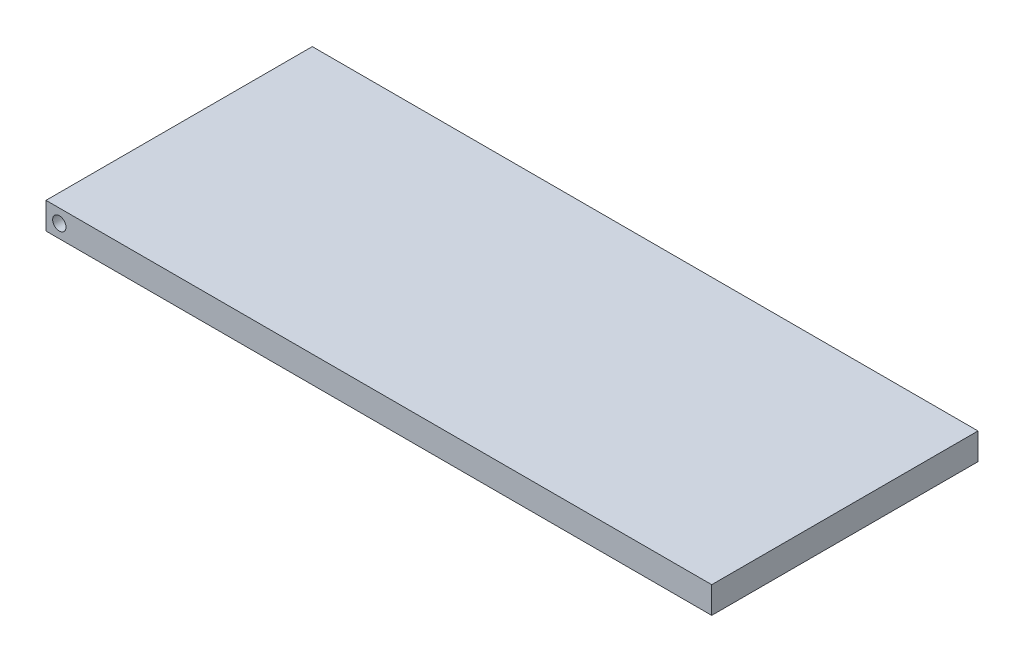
ISO-10303-21;
HEADER;
FILE_DESCRIPTION(('STEP AP214'),'2;1');
FILE_NAME('part.step','',(''),(''),'','','');
FILE_SCHEMA(('AUTOMOTIVE_DESIGN { 1 0 10303 214 1 1 1 1 }'));
ENDSEC;
DATA;
#1=APPLICATION_CONTEXT('core data for automotive mechanical design processes');
#2=APPLICATION_PROTOCOL_DEFINITION('international standard','automotive_design',2000,#1);
#3=PRODUCT_CONTEXT('',#1,'mechanical');
#4=PRODUCT('Part','Part','',(#3));
#5=PRODUCT_RELATED_PRODUCT_CATEGORY('part','',(#4));
#6=PRODUCT_DEFINITION_FORMATION('','',#4);
#7=PRODUCT_DEFINITION_CONTEXT('part definition',#1,'design');
#8=PRODUCT_DEFINITION('design','',#6,#7);
#9=PRODUCT_DEFINITION_SHAPE('','',#8);
#10=(LENGTH_UNIT() NAMED_UNIT(*) SI_UNIT(.MILLI.,.METRE.));
#11=(NAMED_UNIT(*) PLANE_ANGLE_UNIT() SI_UNIT($,.RADIAN.));
#12=(NAMED_UNIT(*) SI_UNIT($,.STERADIAN.) SOLID_ANGLE_UNIT());
#13=UNCERTAINTY_MEASURE_WITH_UNIT(LENGTH_MEASURE(1.E-05),#10,'distance_accuracy_value','');
#14=(GEOMETRIC_REPRESENTATION_CONTEXT(3) GLOBAL_UNCERTAINTY_ASSIGNED_CONTEXT((#13)) GLOBAL_UNIT_ASSIGNED_CONTEXT((#10,
#11,#12)) REPRESENTATION_CONTEXT('',''));
#15=CARTESIAN_POINT('',(0.,0.,0.));
#16=DIRECTION('',(0.,0.,1.));
#17=DIRECTION('',(1.,0.,0.));
#18=AXIS2_PLACEMENT_3D('',#15,#16,#17);
#19=CARTESIAN_POINT('',(0.,0.,-200.));
#20=DIRECTION('',(-1.,0.,0.));
#21=DIRECTION('',(0.,0.,1.));
#22=AXIS2_PLACEMENT_3D('',#19,#20,#21);
#23=PLANE('',#22);
#24=DIRECTION('',(0.,-1.,0.));
#25=VECTOR('',#24,1.);
#26=CARTESIAN_POINT('',(0.,0.,0.));
#27=LINE('',#26,#25);
#28=CARTESIAN_POINT('',(0.,20.,0.));
#29=VERTEX_POINT('',#28);
#30=CARTESIAN_POINT('',(0.,0.,0.));
#31=VERTEX_POINT('',#30);
#32=EDGE_CURVE('E98',#29,#31,#27,.T.);
#33=ORIENTED_EDGE('',*,*,#32,.F.);
#34=DIRECTION('',(0.,0.,1.));
#35=VECTOR('',#34,1.);
#36=CARTESIAN_POINT('',(0.,20.,-200.));
#37=LINE('',#36,#35);
#38=CARTESIAN_POINT('',(0.,20.,-200.));
#39=VERTEX_POINT('',#38);
#40=EDGE_CURVE('E11',#39,#29,#37,.T.);
#41=ORIENTED_EDGE('',*,*,#40,.F.);
#42=DIRECTION('',(0.,-1.,0.));
#43=VECTOR('',#42,1.);
#44=CARTESIAN_POINT('',(0.,0.,-200.));
#45=LINE('',#44,#43);
#46=CARTESIAN_POINT('',(0.,0.,-200.));
#47=VERTEX_POINT('',#46);
#48=EDGE_CURVE('E91',#39,#47,#45,.T.);
#49=ORIENTED_EDGE('',*,*,#48,.T.);
#50=DIRECTION('',(0.,0.,1.));
#51=VECTOR('',#50,1.);
#52=CARTESIAN_POINT('',(0.,0.,-200.));
#53=LINE('',#52,#51);
#54=EDGE_CURVE('E36',#47,#31,#53,.T.);
#55=ORIENTED_EDGE('',*,*,#54,.T.);
#56=EDGE_LOOP('',(#33,#41,#49,#55));
#57=FACE_BOUND('',#56,.T.);
#58=ADVANCED_FACE('F33',(#57),#23,.T.);
#59=CARTESIAN_POINT('',(0.,20.,-200.));
#60=DIRECTION('',(0.,1.,0.));
#61=DIRECTION('',(0.,0.,1.));
#62=AXIS2_PLACEMENT_3D('',#59,#60,#61);
#63=PLANE('',#62);
#64=DIRECTION('',(-1.,0.,0.));
#65=VECTOR('',#64,1.);
#66=CARTESIAN_POINT('',(0.,20.,0.));
#67=LINE('',#66,#65);
#68=CARTESIAN_POINT('',(500.,20.,0.));
#69=VERTEX_POINT('',#68);
#70=EDGE_CURVE('E93',#69,#29,#67,.T.);
#71=ORIENTED_EDGE('',*,*,#70,.F.);
#72=DIRECTION('',(0.,0.,1.));
#73=VECTOR('',#72,1.);
#74=CARTESIAN_POINT('',(500.,20.,-200.));
#75=LINE('',#74,#73);
#76=CARTESIAN_POINT('',(500.,20.,-200.));
#77=VERTEX_POINT('',#76);
#78=EDGE_CURVE('E42',#77,#69,#75,.T.);
#79=ORIENTED_EDGE('',*,*,#78,.F.);
#80=DIRECTION('',(-1.,0.,0.));
#81=VECTOR('',#80,1.);
#82=CARTESIAN_POINT('',(0.,20.,-200.));
#83=LINE('',#82,#81);
#84=EDGE_CURVE('E88',#77,#39,#83,.T.);
#85=ORIENTED_EDGE('',*,*,#84,.T.);
#86=ORIENTED_EDGE('',*,*,#40,.T.);
#87=EDGE_LOOP('',(#71,#79,#85,#86));
#88=FACE_BOUND('',#87,.T.);
#89=ADVANCED_FACE('F109',(#88),#63,.T.);
#90=CARTESIAN_POINT('',(500.,0.,-200.));
#91=DIRECTION('',(1.,0.,0.));
#92=DIRECTION('',(0.,0.,-1.));
#93=AXIS2_PLACEMENT_3D('',#90,#91,#92);
#94=PLANE('',#93);
#95=DIRECTION('',(0.,1.,0.));
#96=VECTOR('',#95,1.);
#97=CARTESIAN_POINT('',(500.,0.,0.));
#98=LINE('',#97,#96);
#99=CARTESIAN_POINT('',(500.,0.,0.));
#100=VERTEX_POINT('',#99);
#101=EDGE_CURVE('E83',#100,#69,#98,.T.);
#102=ORIENTED_EDGE('',*,*,#101,.F.);
#103=DIRECTION('',(0.,0.,1.));
#104=VECTOR('',#103,1.);
#105=CARTESIAN_POINT('',(500.,0.,-200.));
#106=LINE('',#105,#104);
#107=CARTESIAN_POINT('',(500.,0.,-200.));
#108=VERTEX_POINT('',#107);
#109=EDGE_CURVE('E78',#108,#100,#106,.T.);
#110=ORIENTED_EDGE('',*,*,#109,.F.);
#111=DIRECTION('',(0.,1.,0.));
#112=VECTOR('',#111,1.);
#113=CARTESIAN_POINT('',(500.,0.,-200.));
#114=LINE('',#113,#112);
#115=EDGE_CURVE('E81',#108,#77,#114,.T.);
#116=ORIENTED_EDGE('',*,*,#115,.T.);
#117=ORIENTED_EDGE('',*,*,#78,.T.);
#118=EDGE_LOOP('',(#102,#110,#116,#117));
#119=FACE_BOUND('',#118,.T.);
#120=ADVANCED_FACE('F80',(#119),#94,.T.);
#121=CARTESIAN_POINT('',(0.,0.,-200.));
#122=DIRECTION('',(0.,-1.,0.));
#123=DIRECTION('',(0.,0.,-1.));
#124=AXIS2_PLACEMENT_3D('',#121,#122,#123);
#125=PLANE('',#124);
#126=DIRECTION('',(1.,0.,0.));
#127=VECTOR('',#126,1.);
#128=CARTESIAN_POINT('',(0.,0.,0.));
#129=LINE('',#128,#127);
#130=EDGE_CURVE('E101',#31,#100,#129,.T.);
#131=ORIENTED_EDGE('',*,*,#130,.F.);
#132=ORIENTED_EDGE('',*,*,#54,.F.);
#133=DIRECTION('',(1.,0.,0.));
#134=VECTOR('',#133,1.);
#135=CARTESIAN_POINT('',(0.,0.,-200.));
#136=LINE('',#135,#134);
#137=EDGE_CURVE('E87',#47,#108,#136,.T.);
#138=ORIENTED_EDGE('',*,*,#137,.T.);
#139=ORIENTED_EDGE('',*,*,#109,.T.);
#140=EDGE_LOOP('',(#131,#132,#138,#139));
#141=FACE_BOUND('',#140,.T.);
#142=ADVANCED_FACE('F90',(#141),#125,.T.);
#143=CARTESIAN_POINT('',(0.,0.,-200.));
#144=DIRECTION('',(0.,0.,-1.));
#145=DIRECTION('',(-1.,0.,0.));
#146=AXIS2_PLACEMENT_3D('',#143,#144,#145);
#147=PLANE('',#146);
#148=CARTESIAN_POINT('',(10.,10.,-200.));
#149=DIRECTION('',(0.,0.,1.));
#150=DIRECTION('',(1.,0.,0.));
#151=AXIS2_PLACEMENT_3D('',#148,#149,#150);
#152=CIRCLE('',#151,5.);
#153=CARTESIAN_POINT('',(15.,10.,-200.));
#154=VERTEX_POINT('',#153);
#155=EDGE_CURVE('E102',#154,#154,#152,.T.);
#156=ORIENTED_EDGE('',*,*,#155,.T.);
#157=EDGE_LOOP('',(#156));
#158=FACE_BOUND('',#157,.T.);
#159=ORIENTED_EDGE('',*,*,#48,.F.);
#160=ORIENTED_EDGE('',*,*,#84,.F.);
#161=ORIENTED_EDGE('',*,*,#115,.F.);
#162=ORIENTED_EDGE('',*,*,#137,.F.);
#163=EDGE_LOOP('',(#159,#160,#161,#162));
#164=FACE_BOUND('',#163,.T.);
#165=ADVANCED_FACE('F86',(#158,#164),#147,.T.);
#166=CARTESIAN_POINT('',(0.,0.,0.));
#167=DIRECTION('',(0.,0.,-1.));
#168=DIRECTION('',(-1.,0.,0.));
#169=AXIS2_PLACEMENT_3D('',#166,#167,#168);
#170=PLANE('',#169);
#171=CARTESIAN_POINT('',(10.,10.,0.));
#172=DIRECTION('',(0.,0.,1.));
#173=DIRECTION('',(1.,0.,0.));
#174=AXIS2_PLACEMENT_3D('',#171,#172,#173);
#175=CIRCLE('',#174,5.);
#176=CARTESIAN_POINT('',(15.,10.,0.));
#177=VERTEX_POINT('',#176);
#178=EDGE_CURVE('E139',#177,#177,#175,.T.);
#179=ORIENTED_EDGE('',*,*,#178,.F.);
#180=EDGE_LOOP('',(#179));
#181=FACE_BOUND('',#180,.T.);
#182=ORIENTED_EDGE('',*,*,#32,.T.);
#183=ORIENTED_EDGE('',*,*,#130,.T.);
#184=ORIENTED_EDGE('',*,*,#101,.T.);
#185=ORIENTED_EDGE('',*,*,#70,.T.);
#186=EDGE_LOOP('',(#182,#183,#184,#185));
#187=FACE_BOUND('',#186,.T.);
#188=ADVANCED_FACE('F108',(#181,#187),#170,.F.);
#189=CARTESIAN_POINT('',(10.,10.,-200.));
#190=DIRECTION('',(0.,0.,1.));
#191=DIRECTION('',(1.,0.,0.));
#192=AXIS2_PLACEMENT_3D('',#189,#190,#191);
#193=CYLINDRICAL_SURFACE('',#192,5.);
#194=ORIENTED_EDGE('',*,*,#155,.F.);
#195=EDGE_LOOP('',(#194));
#196=FACE_BOUND('',#195,.T.);
#197=ORIENTED_EDGE('',*,*,#178,.T.);
#198=EDGE_LOOP('',(#197));
#199=FACE_BOUND('',#198,.T.);
#200=ADVANCED_FACE('F127',(#196,#199),#193,.F.);
#201=CLOSED_SHELL('',(#58,#89,#120,#142,#165,#188,#200));
#202=MANIFOLD_SOLID_BREP('B2',#201);
#203=ADVANCED_BREP_SHAPE_REPRESENTATION('',(#18,#202),#14);
#204=SHAPE_DEFINITION_REPRESENTATION(#9,#203);
ENDSEC;
END-ISO-10303-21;
